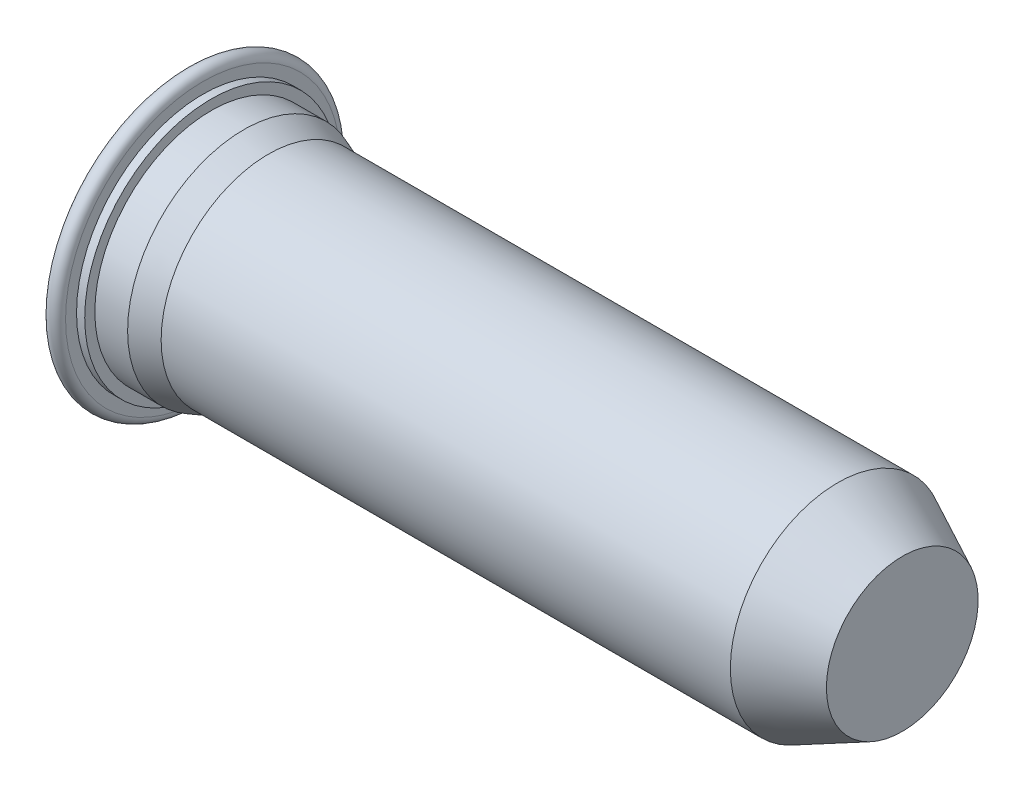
from build123d import *


with BuildPart() as part:
    # BodySke → BaseBody (revolve)
    with BuildSketch(Plane.XY, mode=Mode.PRIVATE) as basebody_sk:
        with BuildLine():
            Line((0, 0), (0, 3.83346))
            Line((0, 3.83346), (0.00508, 3.83346))
            Line((0.00508, 3.83346), (0.00508, 3.83854))
            ThreePointArc((0.00508, 3.83854), (0.23154, 4.065), (0.458, 3.83854))
            Line((0.458, 3.83854), (0.458, 3.5325))
            Line((0.458, 3.5325), (0.687, 3.5325))
            Line((0.687, 3.5325), (0.687, 3.25))
            Line((0.687, 3.25), (1.603130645, 3.25))
            Line((1.603130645, 3.25), (2.29, 3))
            Line((2.29, 3), (18.195732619, 3))
            Line((18.195732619, 3), (20, 2.12))
            Line((20, 2.12), (20, 0))
            Line((20, 0), (0, 0))
        make_face()
    revolve(basebody_sk.sketch.rotate(Axis((0, 0, 0), (1, 0, 0)), 90), axis=Axis((0, 0, 0), (1, 0, 0)))


solid = part.part
